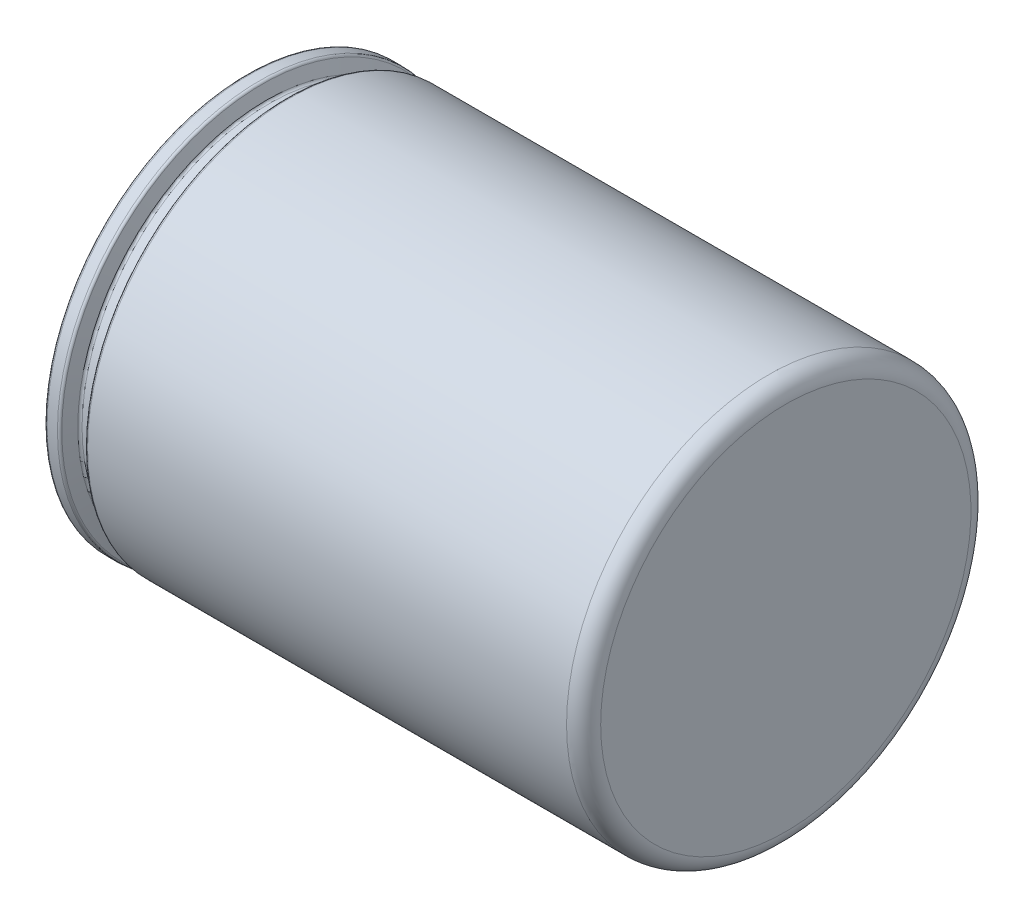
ISO-10303-21;
HEADER;
FILE_DESCRIPTION(('STEP AP214'),'2;1');
FILE_NAME('part.step','',(''),(''),'','','');
FILE_SCHEMA(('AUTOMOTIVE_DESIGN { 1 0 10303 214 1 1 1 1 }'));
ENDSEC;
DATA;
#1=APPLICATION_CONTEXT('core data for automotive mechanical design processes');
#2=APPLICATION_PROTOCOL_DEFINITION('international standard','automotive_design',2000,#1);
#3=PRODUCT_CONTEXT('',#1,'mechanical');
#4=PRODUCT('Part','Part','',(#3));
#5=PRODUCT_RELATED_PRODUCT_CATEGORY('part','',(#4));
#6=PRODUCT_DEFINITION_FORMATION('','',#4);
#7=PRODUCT_DEFINITION_CONTEXT('part definition',#1,'design');
#8=PRODUCT_DEFINITION('design','',#6,#7);
#9=PRODUCT_DEFINITION_SHAPE('','',#8);
#10=(LENGTH_UNIT() NAMED_UNIT(*) SI_UNIT(.MILLI.,.METRE.));
#11=(NAMED_UNIT(*) PLANE_ANGLE_UNIT() SI_UNIT($,.RADIAN.));
#12=(NAMED_UNIT(*) SI_UNIT($,.STERADIAN.) SOLID_ANGLE_UNIT());
#13=UNCERTAINTY_MEASURE_WITH_UNIT(LENGTH_MEASURE(1.E-05),#10,'distance_accuracy_value','');
#14=(GEOMETRIC_REPRESENTATION_CONTEXT(3) GLOBAL_UNCERTAINTY_ASSIGNED_CONTEXT((#13)) GLOBAL_UNIT_ASSIGNED_CONTEXT((#10,
#11,#12)) REPRESENTATION_CONTEXT('',''));
#15=CARTESIAN_POINT('',(0.,0.,0.));
#16=DIRECTION('',(0.,0.,1.));
#17=DIRECTION('',(1.,0.,0.));
#18=AXIS2_PLACEMENT_3D('',#15,#16,#17);
#19=CARTESIAN_POINT('',(152.4,0.,0.));
#20=DIRECTION('',(-1.,0.,0.));
#21=DIRECTION('',(0.,0.,1.));
#22=AXIS2_PLACEMENT_3D('',#19,#20,#21);
#23=PLANE('',#22);
#24=CARTESIAN_POINT('',(152.4,0.,0.));
#25=DIRECTION('',(-1.,0.,0.));
#26=DIRECTION('',(0.,0.,1.));
#27=AXIS2_PLACEMENT_3D('',#24,#25,#26);
#28=CIRCLE('',#27,52.324);
#29=CARTESIAN_POINT('',(152.4,0.,52.324));
#30=VERTEX_POINT('',#29);
#31=EDGE_CURVE('E10',#30,#30,#28,.T.);
#32=ORIENTED_EDGE('',*,*,#31,.F.);
#33=EDGE_LOOP('',(#32));
#34=FACE_BOUND('',#33,.T.);
#35=ADVANCED_FACE('F30',(#34),#23,.F.);
#36=CARTESIAN_POINT('',(147.574,0.,0.));
#37=DIRECTION('',(-1.,0.,0.));
#38=DIRECTION('',(0.,0.,1.));
#39=AXIS2_PLACEMENT_3D('',#36,#37,#38);
#40=TOROIDAL_SURFACE('',#39,52.324,4.826);
#41=CARTESIAN_POINT('',(147.574,0.,0.));
#42=DIRECTION('',(-1.,0.,0.));
#43=DIRECTION('',(0.,0.,1.));
#44=AXIS2_PLACEMENT_3D('',#41,#42,#43);
#45=CIRCLE('',#44,57.15);
#46=CARTESIAN_POINT('',(147.574,0.,57.15));
#47=VERTEX_POINT('',#46);
#48=EDGE_CURVE('E36',#47,#47,#45,.T.);
#49=ORIENTED_EDGE('',*,*,#48,.F.);
#50=EDGE_LOOP('',(#49));
#51=FACE_BOUND('',#50,.T.);
#52=ORIENTED_EDGE('',*,*,#31,.T.);
#53=EDGE_LOOP('',(#52));
#54=FACE_BOUND('',#53,.T.);
#55=ADVANCED_FACE('F168',(#51,#54),#40,.T.);
#56=CARTESIAN_POINT('',(0.,0.,0.));
#57=DIRECTION('',(-1.,0.,0.));
#58=DIRECTION('',(0.,0.,1.));
#59=AXIS2_PLACEMENT_3D('',#56,#57,#58);
#60=CYLINDRICAL_SURFACE('',#59,57.15);
#61=CARTESIAN_POINT('',(12.192,0.,0.));
#62=DIRECTION('',(-1.,0.,0.));
#63=DIRECTION('',(0.,0.,1.));
#64=AXIS2_PLACEMENT_3D('',#61,#62,#63);
#65=CIRCLE('',#64,57.15);
#66=CARTESIAN_POINT('',(12.192,0.,57.15));
#67=VERTEX_POINT('',#66);
#68=EDGE_CURVE('E40',#67,#67,#65,.T.);
#69=ORIENTED_EDGE('',*,*,#68,.F.);
#70=EDGE_LOOP('',(#69));
#71=FACE_BOUND('',#70,.T.);
#72=ORIENTED_EDGE('',*,*,#48,.T.);
#73=EDGE_LOOP('',(#72));
#74=FACE_BOUND('',#73,.T.);
#75=ADVANCED_FACE('F163',(#71,#74),#60,.T.);
#76=CARTESIAN_POINT('',(12.192,0.,0.));
#77=DIRECTION('',(-1.,0.,0.));
#78=DIRECTION('',(0.,0.,1.));
#79=AXIS2_PLACEMENT_3D('',#76,#77,#78);
#80=TOROIDAL_SURFACE('',#79,56.388,0.762);
#81=CARTESIAN_POINT('',(11.43,0.,0.));
#82=DIRECTION('',(-1.,0.,0.));
#83=DIRECTION('',(0.,0.,1.));
#84=AXIS2_PLACEMENT_3D('',#81,#82,#83);
#85=CIRCLE('',#84,56.388);
#86=CARTESIAN_POINT('',(11.43,0.,56.388));
#87=VERTEX_POINT('',#86);
#88=EDGE_CURVE('E44',#87,#87,#85,.T.);
#89=ORIENTED_EDGE('',*,*,#88,.F.);
#90=EDGE_LOOP('',(#89));
#91=FACE_BOUND('',#90,.T.);
#92=ORIENTED_EDGE('',*,*,#68,.T.);
#93=EDGE_LOOP('',(#92));
#94=FACE_BOUND('',#93,.T.);
#95=ADVANCED_FACE('F157',(#91,#94),#80,.T.);
#96=CARTESIAN_POINT('',(11.43,56.388,0.));
#97=DIRECTION('',(1.,0.,0.));
#98=DIRECTION('',(0.,0.,-1.));
#99=AXIS2_PLACEMENT_3D('',#96,#97,#98);
#100=PLANE('',#99);
#101=CARTESIAN_POINT('',(11.43,0.,0.));
#102=DIRECTION('',(-1.,0.,0.));
#103=DIRECTION('',(0.,0.,1.));
#104=AXIS2_PLACEMENT_3D('',#101,#102,#103);
#105=CIRCLE('',#104,53.594);
#106=CARTESIAN_POINT('',(11.43,0.,53.594));
#107=VERTEX_POINT('',#106);
#108=EDGE_CURVE('E49',#107,#107,#105,.T.);
#109=ORIENTED_EDGE('',*,*,#108,.F.);
#110=EDGE_LOOP('',(#109));
#111=FACE_BOUND('',#110,.T.);
#112=ORIENTED_EDGE('',*,*,#88,.T.);
#113=EDGE_LOOP('',(#112));
#114=FACE_BOUND('',#113,.T.);
#115=ADVANCED_FACE('F151',(#111,#114),#100,.F.);
#116=CARTESIAN_POINT('',(10.668,0.,0.));
#117=DIRECTION('',(-1.,0.,0.));
#118=DIRECTION('',(0.,0.,1.));
#119=AXIS2_PLACEMENT_3D('',#116,#117,#118);
#120=TOROIDAL_SURFACE('',#119,53.594,0.762);
#121=CARTESIAN_POINT('',(10.668,0.,0.));
#122=DIRECTION('',(-1.,0.,0.));
#123=DIRECTION('',(0.,0.,1.));
#124=AXIS2_PLACEMENT_3D('',#121,#122,#123);
#125=CIRCLE('',#124,52.832);
#126=CARTESIAN_POINT('',(10.668,0.,52.832));
#127=VERTEX_POINT('',#126);
#128=EDGE_CURVE('E52',#127,#127,#125,.T.);
#129=ORIENTED_EDGE('',*,*,#128,.F.);
#130=EDGE_LOOP('',(#129));
#131=FACE_BOUND('',#130,.T.);
#132=ORIENTED_EDGE('',*,*,#108,.T.);
#133=EDGE_LOOP('',(#132));
#134=FACE_BOUND('',#133,.T.);
#135=ADVANCED_FACE('F145',(#131,#134),#120,.F.);
#136=CARTESIAN_POINT('',(0.,0.,0.));
#137=DIRECTION('',(-1.,0.,0.));
#138=DIRECTION('',(0.,0.,1.));
#139=AXIS2_PLACEMENT_3D('',#136,#137,#138);
#140=CYLINDRICAL_SURFACE('',#139,52.832);
#141=CARTESIAN_POINT('',(6.32158161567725,0.,0.));
#142=DIRECTION('',(-1.,0.,0.));
#143=DIRECTION('',(0.,0.,1.));
#144=AXIS2_PLACEMENT_3D('',#141,#142,#143);
#145=CIRCLE('',#144,52.832);
#146=CARTESIAN_POINT('',(6.32158161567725,0.,52.832));
#147=VERTEX_POINT('',#146);
#148=EDGE_CURVE('E55',#147,#147,#145,.T.);
#149=ORIENTED_EDGE('',*,*,#148,.F.);
#150=EDGE_LOOP('',(#149));
#151=FACE_BOUND('',#150,.T.);
#152=ORIENTED_EDGE('',*,*,#128,.T.);
#153=EDGE_LOOP('',(#152));
#154=FACE_BOUND('',#153,.T.);
#155=ADVANCED_FACE('F139',(#151,#154),#140,.T.);
#156=CARTESIAN_POINT('',(6.32158161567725,0.,0.));
#157=DIRECTION('',(-1.,0.,0.));
#158=DIRECTION('',(0.,0.,1.));
#159=AXIS2_PLACEMENT_3D('',#156,#157,#158);
#160=TOROIDAL_SURFACE('',#159,53.594,0.762);
#161=CARTESIAN_POINT('',(5.60553583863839,0.,0.));
#162=DIRECTION('',(-1.,0.,0.));
#163=DIRECTION('',(0.,0.,1.));
#164=AXIS2_PLACEMENT_3D('',#161,#162,#163);
#165=CIRCLE('',#164,53.3333806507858);
#166=CARTESIAN_POINT('',(5.60553583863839,0.,53.3333806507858));
#167=VERTEX_POINT('',#166);
#168=EDGE_CURVE('E58',#167,#167,#165,.T.);
#169=ORIENTED_EDGE('',*,*,#168,.F.);
#170=EDGE_LOOP('',(#169));
#171=FACE_BOUND('',#170,.T.);
#172=ORIENTED_EDGE('',*,*,#148,.T.);
#173=EDGE_LOOP('',(#172));
#174=FACE_BOUND('',#173,.T.);
#175=ADVANCED_FACE('F133',(#171,#174),#160,.F.);
#176=CARTESIAN_POINT('',(5.60553583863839,0.,0.));
#177=DIRECTION('',(-1.,0.,0.));
#178=DIRECTION('',(0.,0.,1.));
#179=AXIS2_PLACEMENT_3D('',#176,#177,#178);
#180=CONICAL_SURFACE('',#179,53.3333806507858,1.22173047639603);
#181=CARTESIAN_POINT('',(4.39888763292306,0.,0.));
#182=DIRECTION('',(-1.,0.,0.));
#183=DIRECTION('',(0.,0.,1.));
#184=AXIS2_PLACEMENT_3D('',#181,#182,#183);
#185=CIRCLE('',#184,56.6486193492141);
#186=CARTESIAN_POINT('',(4.39888763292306,0.,56.6486193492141));
#187=VERTEX_POINT('',#186);
#188=EDGE_CURVE('E61',#187,#187,#185,.T.);
#189=ORIENTED_EDGE('',*,*,#188,.F.);
#190=EDGE_LOOP('',(#189));
#191=FACE_BOUND('',#190,.T.);
#192=ORIENTED_EDGE('',*,*,#168,.T.);
#193=EDGE_LOOP('',(#192));
#194=FACE_BOUND('',#193,.T.);
#195=ADVANCED_FACE('F127',(#191,#194),#180,.T.);
#196=CARTESIAN_POINT('',(3.6828418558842,0.,0.));
#197=DIRECTION('',(-1.,0.,0.));
#198=DIRECTION('',(0.,0.,1.));
#199=AXIS2_PLACEMENT_3D('',#196,#197,#198);
#200=TOROIDAL_SURFACE('',#199,56.388,0.762);
#201=CARTESIAN_POINT('',(3.6828418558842,0.,0.));
#202=DIRECTION('',(-1.,0.,0.));
#203=DIRECTION('',(0.,0.,1.));
#204=AXIS2_PLACEMENT_3D('',#201,#202,#203);
#205=CIRCLE('',#204,57.15);
#206=CARTESIAN_POINT('',(3.6828418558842,0.,57.15));
#207=VERTEX_POINT('',#206);
#208=EDGE_CURVE('E64',#207,#207,#205,.T.);
#209=ORIENTED_EDGE('',*,*,#208,.F.);
#210=EDGE_LOOP('',(#209));
#211=FACE_BOUND('',#210,.T.);
#212=ORIENTED_EDGE('',*,*,#188,.T.);
#213=EDGE_LOOP('',(#212));
#214=FACE_BOUND('',#213,.T.);
#215=ADVANCED_FACE('F121',(#211,#214),#200,.T.);
#216=CARTESIAN_POINT('',(0.,0.,0.));
#217=DIRECTION('',(-1.,0.,0.));
#218=DIRECTION('',(0.,0.,1.));
#219=AXIS2_PLACEMENT_3D('',#216,#217,#218);
#220=CYLINDRICAL_SURFACE('',#219,57.15);
#221=CARTESIAN_POINT('',(0.762000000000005,0.,0.));
#222=DIRECTION('',(-1.,0.,0.));
#223=DIRECTION('',(0.,0.,1.));
#224=AXIS2_PLACEMENT_3D('',#221,#222,#223);
#225=CIRCLE('',#224,57.15);
#226=CARTESIAN_POINT('',(0.762000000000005,0.,57.15));
#227=VERTEX_POINT('',#226);
#228=EDGE_CURVE('E67',#227,#227,#225,.T.);
#229=ORIENTED_EDGE('',*,*,#228,.F.);
#230=EDGE_LOOP('',(#229));
#231=FACE_BOUND('',#230,.T.);
#232=ORIENTED_EDGE('',*,*,#208,.T.);
#233=EDGE_LOOP('',(#232));
#234=FACE_BOUND('',#233,.T.);
#235=ADVANCED_FACE('F115',(#231,#234),#220,.T.);
#236=CARTESIAN_POINT('',(0.762,0.,0.));
#237=DIRECTION('',(-1.,0.,0.));
#238=DIRECTION('',(0.,0.,1.));
#239=AXIS2_PLACEMENT_3D('',#236,#237,#238);
#240=TOROIDAL_SURFACE('',#239,56.388,0.761999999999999);
#241=CARTESIAN_POINT('',(0.,0.,0.));
#242=DIRECTION('',(-1.,0.,0.));
#243=DIRECTION('',(0.,0.,1.));
#244=AXIS2_PLACEMENT_3D('',#241,#242,#243);
#245=CIRCLE('',#244,56.388);
#246=CARTESIAN_POINT('',(0.,0.,56.388));
#247=VERTEX_POINT('',#246);
#248=EDGE_CURVE('E70',#247,#247,#245,.T.);
#249=ORIENTED_EDGE('',*,*,#248,.F.);
#250=EDGE_LOOP('',(#249));
#251=FACE_BOUND('',#250,.T.);
#252=ORIENTED_EDGE('',*,*,#228,.T.);
#253=EDGE_LOOP('',(#252));
#254=FACE_BOUND('',#253,.T.);
#255=ADVANCED_FACE('F109',(#251,#254),#240,.T.);
#256=CARTESIAN_POINT('',(0.,49.149,0.));
#257=DIRECTION('',(1.,0.,0.));
#258=DIRECTION('',(0.,0.,-1.));
#259=AXIS2_PLACEMENT_3D('',#256,#257,#258);
#260=PLANE('',#259);
#261=CARTESIAN_POINT('',(0.,0.,0.));
#262=DIRECTION('',(-1.,0.,0.));
#263=DIRECTION('',(0.,0.,1.));
#264=AXIS2_PLACEMENT_3D('',#261,#262,#263);
#265=CIRCLE('',#264,49.149);
#266=CARTESIAN_POINT('',(0.,0.,49.149));
#267=VERTEX_POINT('',#266);
#268=EDGE_CURVE('E73',#267,#267,#265,.T.);
#269=ORIENTED_EDGE('',*,*,#268,.F.);
#270=EDGE_LOOP('',(#269));
#271=FACE_BOUND('',#270,.T.);
#272=ORIENTED_EDGE('',*,*,#248,.T.);
#273=EDGE_LOOP('',(#272));
#274=FACE_BOUND('',#273,.T.);
#275=ADVANCED_FACE('F103',(#271,#274),#260,.F.);
#276=CARTESIAN_POINT('',(1.524,0.,0.));
#277=DIRECTION('',(-1.,0.,0.));
#278=DIRECTION('',(0.,0.,1.));
#279=AXIS2_PLACEMENT_3D('',#276,#277,#278);
#280=TOROIDAL_SURFACE('',#279,49.149,1.524);
#281=CARTESIAN_POINT('',(1.52400000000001,0.,0.));
#282=DIRECTION('',(-1.,0.,0.));
#283=DIRECTION('',(0.,0.,1.));
#284=AXIS2_PLACEMENT_3D('',#281,#282,#283);
#285=CIRCLE('',#284,47.625);
#286=CARTESIAN_POINT('',(1.52400000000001,0.,47.625));
#287=VERTEX_POINT('',#286);
#288=EDGE_CURVE('E76',#287,#287,#285,.T.);
#289=ORIENTED_EDGE('',*,*,#288,.F.);
#290=EDGE_LOOP('',(#289));
#291=FACE_BOUND('',#290,.T.);
#292=ORIENTED_EDGE('',*,*,#268,.T.);
#293=EDGE_LOOP('',(#292));
#294=FACE_BOUND('',#293,.T.);
#295=ADVANCED_FACE('F97',(#291,#294),#280,.T.);
#296=CARTESIAN_POINT('',(0.,0.,0.));
#297=DIRECTION('',(-1.,0.,0.));
#298=DIRECTION('',(0.,0.,1.));
#299=AXIS2_PLACEMENT_3D('',#296,#297,#298);
#300=CYLINDRICAL_SURFACE('',#299,47.625);
#301=CARTESIAN_POINT('',(125.349,0.,0.));
#302=DIRECTION('',(-1.,0.,0.));
#303=DIRECTION('',(0.,0.,1.));
#304=AXIS2_PLACEMENT_3D('',#301,#302,#303);
#305=CIRCLE('',#304,47.625);
#306=CARTESIAN_POINT('',(125.349,0.,47.625));
#307=VERTEX_POINT('',#306);
#308=EDGE_CURVE('E79',#307,#307,#305,.T.);
#309=ORIENTED_EDGE('',*,*,#308,.F.);
#310=EDGE_LOOP('',(#309));
#311=FACE_BOUND('',#310,.T.);
#312=ORIENTED_EDGE('',*,*,#288,.T.);
#313=EDGE_LOOP('',(#312));
#314=FACE_BOUND('',#313,.T.);
#315=ADVANCED_FACE('F91',(#311,#314),#300,.F.);
#316=CARTESIAN_POINT('',(125.349,0.,0.));
#317=DIRECTION('',(-1.,0.,0.));
#318=DIRECTION('',(0.,0.,1.));
#319=AXIS2_PLACEMENT_3D('',#316,#317,#318);
#320=TOROIDAL_SURFACE('',#319,44.45,3.175);
#321=CARTESIAN_POINT('',(128.524,0.,0.));
#322=DIRECTION('',(-1.,0.,0.));
#323=DIRECTION('',(0.,0.,1.));
#324=AXIS2_PLACEMENT_3D('',#321,#322,#323);
#325=CIRCLE('',#324,44.45);
#326=CARTESIAN_POINT('',(128.524,0.,44.45));
#327=VERTEX_POINT('',#326);
#328=EDGE_CURVE('E82',#327,#327,#325,.T.);
#329=ORIENTED_EDGE('',*,*,#328,.F.);
#330=EDGE_LOOP('',(#329));
#331=FACE_BOUND('',#330,.T.);
#332=ORIENTED_EDGE('',*,*,#308,.T.);
#333=EDGE_LOOP('',(#332));
#334=FACE_BOUND('',#333,.T.);
#335=ADVANCED_FACE('F88',(#331,#334),#320,.F.);
#336=CARTESIAN_POINT('',(128.524,44.45,0.));
#337=DIRECTION('',(1.,0.,0.));
#338=DIRECTION('',(0.,0.,-1.));
#339=AXIS2_PLACEMENT_3D('',#336,#337,#338);
#340=PLANE('',#339);
#341=ORIENTED_EDGE('',*,*,#328,.T.);
#342=EDGE_LOOP('',(#341));
#343=FACE_BOUND('',#342,.T.);
#344=ADVANCED_FACE('F86',(#343),#340,.F.);
#345=CLOSED_SHELL('',(#35,#55,#75,#95,#115,#135,#155,#175,#195,#215,#235,#255,#275,#295,#315,
#335,#344));
#346=MANIFOLD_SOLID_BREP('B2',#345);
#347=ADVANCED_BREP_SHAPE_REPRESENTATION('',(#18,#346),#14);
#348=SHAPE_DEFINITION_REPRESENTATION(#9,#347);
ENDSEC;
END-ISO-10303-21;
